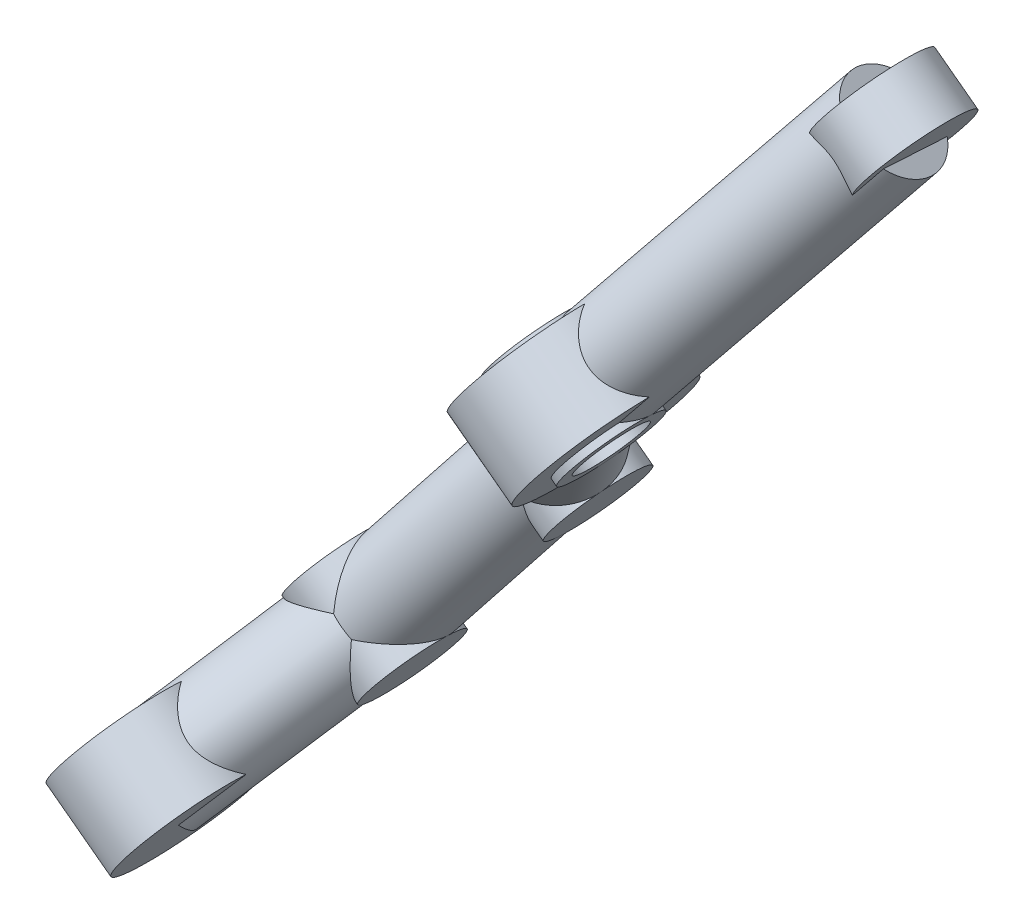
ISO-10303-21;
HEADER;
FILE_DESCRIPTION(('STEP AP214'),'2;1');
FILE_NAME('part.step','',(''),(''),'','','');
FILE_SCHEMA(('AUTOMOTIVE_DESIGN { 1 0 10303 214 1 1 1 1 }'));
ENDSEC;
DATA;
#1=APPLICATION_CONTEXT('core data for automotive mechanical design processes');
#2=APPLICATION_PROTOCOL_DEFINITION('international standard','automotive_design',2000,#1);
#3=PRODUCT_CONTEXT('',#1,'mechanical');
#4=PRODUCT('Part','Part','',(#3));
#5=PRODUCT_RELATED_PRODUCT_CATEGORY('part','',(#4));
#6=PRODUCT_DEFINITION_FORMATION('','',#4);
#7=PRODUCT_DEFINITION_CONTEXT('part definition',#1,'design');
#8=PRODUCT_DEFINITION('design','',#6,#7);
#9=PRODUCT_DEFINITION_SHAPE('','',#8);
#10=(LENGTH_UNIT() NAMED_UNIT(*) SI_UNIT(.MILLI.,.METRE.));
#11=(NAMED_UNIT(*) PLANE_ANGLE_UNIT() SI_UNIT($,.RADIAN.));
#12=(NAMED_UNIT(*) SI_UNIT($,.STERADIAN.) SOLID_ANGLE_UNIT());
#13=UNCERTAINTY_MEASURE_WITH_UNIT(LENGTH_MEASURE(1.E-05),#10,'distance_accuracy_value','');
#14=(GEOMETRIC_REPRESENTATION_CONTEXT(3) GLOBAL_UNCERTAINTY_ASSIGNED_CONTEXT((#13)) GLOBAL_UNIT_ASSIGNED_CONTEXT((#10,
#11,#12)) REPRESENTATION_CONTEXT('',''));
#15=CARTESIAN_POINT('',(0.,0.,0.));
#16=DIRECTION('',(0.,0.,1.));
#17=DIRECTION('',(1.,0.,0.));
#18=AXIS2_PLACEMENT_3D('',#15,#16,#17);
#19=CARTESIAN_POINT('',(-263.128358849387,316.504901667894,-22.));
#20=DIRECTION('',(-0.479301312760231,-0.640523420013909,0.600000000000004));
#21=DIRECTION('',(0.,-0.683643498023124,-0.729816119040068));
#22=AXIS2_PLACEMENT_3D('',#19,#20,#21);
#23=PLANE('',#22);
#24=CARTESIAN_POINT('',(-263.128358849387,316.504901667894,-22.));
#25=DIRECTION('',(-0.479301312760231,-0.640523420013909,0.600000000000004));
#26=DIRECTION('',(0.,-0.683643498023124,-0.729816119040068));
#27=AXIS2_PLACEMENT_3D('',#24,#25,#26);
#28=CIRCLE('',#27,3.5);
#29=CARTESIAN_POINT('',(-261.374450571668,313.841481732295,-23.442220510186));
#30=VERTEX_POINT('',#29);
#31=CARTESIAN_POINT('',(-260.078341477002,315.573561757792,-20.557779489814));
#32=VERTEX_POINT('',#31);
#33=EDGE_CURVE('E276',#30,#32,#28,.T.);
#34=ORIENTED_EDGE('',*,*,#33,.T.);
#35=DIRECTION('',(-0.359475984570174,-0.480392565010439,-0.799999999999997));
#36=VECTOR('',#35,1.);
#37=CARTESIAN_POINT('',(-260.726396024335,314.707521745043,-22.));
#38=LINE('',#37,#36);
#39=EDGE_CURVE('E301',#32,#30,#38,.T.);
#40=ORIENTED_EDGE('',*,*,#39,.T.);
#41=EDGE_LOOP('',(#34,#40));
#42=FACE_BOUND('',#41,.T.);
#43=ADVANCED_FACE('F100',(#42),#23,.T.);
#44=CARTESIAN_POINT('',(-255.938839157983,326.112752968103,-31.));
#45=DIRECTION('',(-0.479301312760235,-0.640523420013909,0.6));
#46=DIRECTION('',(0.,-0.683643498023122,-0.72981611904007));
#47=AXIS2_PLACEMENT_3D('',#44,#45,#46);
#48=CYLINDRICAL_SURFACE('',#47,3.5);
#49=CARTESIAN_POINT('',(-255.938839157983,326.112752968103,-31.));
#50=DIRECTION('',(-0.905065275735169,-0.0292719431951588,0.42426406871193));
#51=DIRECTION('',(0.227230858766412,-0.876564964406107,0.424264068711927));
#52=AXIS2_PLACEMENT_3D('',#49,#50,#51);
#53=ELLIPSE('',#52,4.94974746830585,3.5);
#54=CARTESIAN_POINT('',(-254.450036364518,326.718397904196,-27.7822113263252));
#55=VERTEX_POINT('',#54);
#56=CARTESIAN_POINT('',(-254.814103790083,321.773977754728,-28.9));
#57=VERTEX_POINT('',#56);
#58=EDGE_CURVE('E512',#55,#57,#53,.F.);
#59=ORIENTED_EDGE('',*,*,#58,.F.);
#60=CARTESIAN_POINT('',(-255.938839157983,326.112752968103,-31.));
#61=DIRECTION('',(-0.55081797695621,-0.736096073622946,0.393398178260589));
#62=DIRECTION('',(-0.235695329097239,-0.314975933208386,-0.919368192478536));
#63=AXIS2_PLACEMENT_3D('',#60,#61,#62);
#64=ELLIPSE('',#63,3.60255219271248,3.49999999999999);
#65=CARTESIAN_POINT('',(-255.777774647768,327.711939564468,-27.7822113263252));
#66=VERTEX_POINT('',#65);
#67=EDGE_CURVE('E484',#55,#66,#64,.T.);
#68=ORIENTED_EDGE('',*,*,#67,.T.);
#69=CARTESIAN_POINT('',(-255.938839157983,326.112752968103,-31.));
#70=DIRECTION('',(0.227230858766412,-0.876564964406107,0.424264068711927));
#71=DIRECTION('',(-0.905065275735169,-0.0292719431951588,0.42426406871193));
#72=AXIS2_PLACEMENT_3D('',#69,#70,#71);
#73=ELLIPSE('',#72,4.94974746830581,3.5);
#74=CARTESIAN_POINT('',(-260.418683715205,325.96786424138,-28.9));
#75=VERTEX_POINT('',#74);
#76=EDGE_CURVE('E505',#75,#66,#73,.F.);
#77=ORIENTED_EDGE('',*,*,#76,.F.);
#78=CARTESIAN_POINT('',(-257.197005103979,324.431378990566,-33.8));
#79=VERTEX_POINT('',#78);
#80=EDGE_CURVE('E508',#79,#75,#73,.F.);
#81=ORIENTED_EDGE('',*,*,#80,.F.);
#82=EDGE_CURVE('E509',#57,#79,#53,.F.);
#83=ORIENTED_EDGE('',*,*,#82,.F.);
#84=EDGE_LOOP('',(#59,#68,#77,#81,#83));
#85=FACE_BOUND('',#84,.T.);
#86=CARTESIAN_POINT('',(-257.843028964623,318.560764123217,-23.3559932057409));
#87=CARTESIAN_POINT('',(-257.870763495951,318.614341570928,-23.2627581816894));
#88=CARTESIAN_POINT('',(-257.903463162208,318.667500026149,-23.170817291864));
#89=CARTESIAN_POINT('',(-257.977981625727,318.773137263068,-22.9903806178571));
#90=CARTESIAN_POINT('',(-258.019794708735,318.825616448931,-22.9018827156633));
#91=CARTESIAN_POINT('',(-258.11203792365,318.93042949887,-22.7285584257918));
#92=CARTESIAN_POINT('',(-258.162517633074,318.982760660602,-22.6437568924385));
#93=CARTESIAN_POINT('',(-258.271191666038,319.087312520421,-22.4791614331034));
#94=CARTESIAN_POINT('',(-258.329387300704,319.139533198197,-22.3993683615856));
#95=CARTESIAN_POINT('',(-258.452725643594,319.244226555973,-22.2457518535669));
#96=CARTESIAN_POINT('',(-258.517857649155,319.29669873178,-22.171919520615));
#97=CARTESIAN_POINT('',(-258.654442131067,319.402479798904,-22.0310791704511));
#98=CARTESIAN_POINT('',(-258.725895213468,319.455788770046,-21.9640718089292));
#99=CARTESIAN_POINT('',(-258.948445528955,319.617634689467,-21.7752716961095));
#100=CARTESIAN_POINT('',(-259.108243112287,319.728504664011,-21.6650616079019));
#101=CARTESIAN_POINT('',(-259.389881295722,319.92347788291,-21.5162609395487));
#102=CARTESIAN_POINT('',(-259.507529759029,320.004810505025,-21.4660380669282));
#103=CARTESIAN_POINT('',(-259.746705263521,320.17282529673,-21.3898051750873));
#104=CARTESIAN_POINT('',(-259.868224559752,320.259497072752,-21.3637496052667));
#105=CARTESIAN_POINT('',(-260.111621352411,320.43752746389,-21.3385991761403));
#106=CARTESIAN_POINT('',(-260.233497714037,320.528906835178,-21.3396361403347));
#107=CARTESIAN_POINT('',(-260.473041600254,320.712902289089,-21.3688613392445));
#108=CARTESIAN_POINT('',(-260.590704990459,320.805519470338,-21.3970755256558));
#109=CARTESIAN_POINT('',(-260.838313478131,321.00311578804,-21.484184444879));
#110=CARTESIAN_POINT('',(-260.96710113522,321.107626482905,-21.5473576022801));
#111=CARTESIAN_POINT('',(-261.215801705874,321.308092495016,-21.6997528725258));
#112=CARTESIAN_POINT('',(-261.335690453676,321.404024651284,-21.7890428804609));
#113=CARTESIAN_POINT('',(-261.599588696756,321.60778988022,-22.0149625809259));
#114=CARTESIAN_POINT('',(-261.741235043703,321.711709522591,-22.1578608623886));
#115=CARTESIAN_POINT('',(-262.015022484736,321.892352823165,-22.4674356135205));
#116=CARTESIAN_POINT('',(-262.147177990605,321.969118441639,-22.6340748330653));
#117=CARTESIAN_POINT('',(-262.339292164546,322.059101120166,-22.8966596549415));
#118=CARTESIAN_POINT('',(-262.402273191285,322.084892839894,-22.9862327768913));
#119=CARTESIAN_POINT('',(-262.526152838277,322.127282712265,-23.1687503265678));
#120=CARTESIAN_POINT('',(-262.58705390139,322.143892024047,-23.2616905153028));
#121=CARTESIAN_POINT('',(-262.646954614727,322.155523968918,-23.3559932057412));
#122=B_SPLINE_CURVE_WITH_KNOTS('',3,(#86,#87,#88,#89,#90,#91,#92,#93,#94,#95,#96,#97,#98,#99,
#100,#101,#102,#103,#104,#105,#106,#107,#108,#109,#110,#111,#112,#113,#114,#115,#116,#117,#118,
#119,#120,#121),.UNSPECIFIED.,.F.,.F.,(4,2,2,2,2,2,2,2,2,2,2,2,2,2,2,2,2,4),(0.,
0.332966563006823,0.66572494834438,1.00045449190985,1.3352409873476,1.66951820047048,
2.00382749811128,2.66972985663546,3.1228015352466,3.57501751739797,4.02943424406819,
4.48428532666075,5.01385226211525,5.54480832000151,6.22088122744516,6.89590480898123,
7.23299855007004,7.56968172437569),.UNSPECIFIED.);
#123=CARTESIAN_POINT('',(-257.843028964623,318.560764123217,-23.3559932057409));
#124=VERTEX_POINT('',#123);
#125=CARTESIAN_POINT('',(-262.646954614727,322.155523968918,-23.3559932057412));
#126=VERTEX_POINT('',#125);
#127=EDGE_CURVE('E118',#124,#126,#122,.T.);
#128=ORIENTED_EDGE('',*,*,#127,.F.);
#129=DIRECTION('',(-0.479301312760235,-0.640523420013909,0.6));
#130=VECTOR('',#129,1.);
#131=CARTESIAN_POINT('',(-252.888821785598,325.181413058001,-29.557779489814));
#132=LINE('',#131,#130);
#133=EDGE_CURVE('E12',#124,#32,#132,.T.);
#134=ORIENTED_EDGE('',*,*,#133,.T.);
#135=ORIENTED_EDGE('',*,*,#33,.F.);
#136=DIRECTION('',(-0.479301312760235,-0.640523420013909,0.6));
#137=VECTOR('',#136,1.);
#138=CARTESIAN_POINT('',(-254.184930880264,323.449333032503,-32.442220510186));
#139=LINE('',#138,#137);
#140=CARTESIAN_POINT('',(-259.139138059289,316.82868409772,-26.2404342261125));
#141=VERTEX_POINT('',#140);
#142=EDGE_CURVE('E270',#30,#141,#139,.F.);
#143=ORIENTED_EDGE('',*,*,#142,.T.);
#144=CARTESIAN_POINT('',(-263.943063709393,320.423443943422,-26.2404342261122));
#145=CARTESIAN_POINT('',(-263.948800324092,320.325136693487,-26.2917693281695));
#146=CARTESIAN_POINT('',(-263.951366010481,320.224850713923,-26.3395642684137));
#147=CARTESIAN_POINT('',(-263.950003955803,320.021449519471,-26.4284221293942));
#148=CARTESIAN_POINT('',(-263.94608027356,319.918336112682,-26.469489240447));
#149=CARTESIAN_POINT('',(-263.931552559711,319.709666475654,-26.5455275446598));
#150=CARTESIAN_POINT('',(-263.920909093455,319.604099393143,-26.5804611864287));
#151=CARTESIAN_POINT('',(-263.892639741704,319.39209720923,-26.6444042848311));
#152=CARTESIAN_POINT('',(-263.875012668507,319.285661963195,-26.6734127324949));
#153=CARTESIAN_POINT('',(-263.832415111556,319.073069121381,-26.7259561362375));
#154=CARTESIAN_POINT('',(-263.807455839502,318.966911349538,-26.7494993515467));
#155=CARTESIAN_POINT('',(-263.749681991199,318.755810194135,-26.7916828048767));
#156=CARTESIAN_POINT('',(-263.716866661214,318.650866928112,-26.8103225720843));
#157=CARTESIAN_POINT('',(-263.605785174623,318.340057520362,-26.8595835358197));
#158=CARTESIAN_POINT('',(-263.514721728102,318.137333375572,-26.8837507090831));
#159=CARTESIAN_POINT('',(-263.328354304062,317.815043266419,-26.9132893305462));
#160=CARTESIAN_POINT('',(-263.243707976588,317.689607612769,-26.9221993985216));
#161=CARTESIAN_POINT('',(-263.05510782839,317.454005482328,-26.9351209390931));
#162=CARTESIAN_POINT('',(-262.951190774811,317.343810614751,-26.9391416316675));
#163=CARTESIAN_POINT('',(-262.724778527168,317.143082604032,-26.9430304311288));
#164=CARTESIAN_POINT('',(-262.602195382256,317.052647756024,-26.9428782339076));
#165=CARTESIAN_POINT('',(-262.342928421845,316.895009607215,-26.9383428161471));
#166=CARTESIAN_POINT('',(-262.206231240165,316.827828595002,-26.9339555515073));
#167=CARTESIAN_POINT('',(-261.900961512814,316.707288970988,-26.9190282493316));
#168=CARTESIAN_POINT('',(-261.730841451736,316.658013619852,-26.90759591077));
#169=CARTESIAN_POINT('',(-261.385669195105,316.586469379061,-26.8759660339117));
#170=CARTESIAN_POINT('',(-261.21060523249,316.564271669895,-26.8557455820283));
#171=CARTESIAN_POINT('',(-260.812903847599,316.53931681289,-26.7973236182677));
#172=CARTESIAN_POINT('',(-260.590341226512,316.543531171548,-26.7557181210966));
#173=CARTESIAN_POINT('',(-260.153376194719,316.580953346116,-26.6504126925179));
#174=CARTESIAN_POINT('',(-259.938961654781,316.614116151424,-26.5867471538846));
#175=CARTESIAN_POINT('',(-259.62883742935,316.681838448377,-26.4718899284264));
#176=CARTESIAN_POINT('',(-259.527438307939,316.707387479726,-26.4304094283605));
#177=CARTESIAN_POINT('',(-259.329471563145,316.764005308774,-26.3406357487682));
#178=CARTESIAN_POINT('',(-259.232898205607,316.795067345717,-26.292350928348));
#179=CARTESIAN_POINT('',(-259.139138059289,316.82868409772,-26.2404342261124));
#180=B_SPLINE_CURVE_WITH_KNOTS('',3,(#144,#145,#146,#147,#148,#149,#150,#151,#152,#153,#154,
#155,#156,#157,#158,#159,#160,#161,#162,#163,#164,#165,#166,#167,#168,#169,#170,#171,#172,#173,
#174,#175,#176,#177,#178,#179),.UNSPECIFIED.,.F.,.F.,(4,2,2,2,2,2,2,2,2,2,2,2,2,2,2,2,2,4),(0.,
0.332966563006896,0.665724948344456,1.00045449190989,1.33524098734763,1.66951820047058,
2.00382749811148,2.66972985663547,3.12280153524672,3.57501751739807,4.0294342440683,
4.48428532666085,5.01385226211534,5.54480832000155,6.22088122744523,6.89590480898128,
7.23299855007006,7.56968172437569),.UNSPECIFIED.);
#181=CARTESIAN_POINT('',(-263.943063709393,320.423443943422,-26.2404342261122));
#182=VERTEX_POINT('',#181);
#183=EDGE_CURVE('E273',#182,#141,#180,.T.);
#184=ORIENTED_EDGE('',*,*,#183,.F.);
#185=DIRECTION('',(-0.479301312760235,-0.640523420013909,0.6));
#186=VECTOR('',#185,1.);
#187=CARTESIAN_POINT('',(-258.988856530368,327.044092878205,-32.4422205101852));
#188=LINE('',#187,#186);
#189=CARTESIAN_POINT('',(-266.178376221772,317.436241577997,-23.4422205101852));
#190=VERTEX_POINT('',#189);
#191=EDGE_CURVE('E280',#190,#182,#188,.F.);
#192=ORIENTED_EDGE('',*,*,#191,.F.);
#193=CARTESIAN_POINT('',(-264.882267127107,319.168321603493,-20.5577794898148));
#194=VERTEX_POINT('',#193);
#195=EDGE_CURVE('E541',#194,#190,#28,.T.);
#196=ORIENTED_EDGE('',*,*,#195,.F.);
#197=DIRECTION('',(-0.479301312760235,-0.640523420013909,0.6));
#198=VECTOR('',#197,1.);
#199=CARTESIAN_POINT('',(-257.692747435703,328.776172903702,-29.5577794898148));
#200=LINE('',#199,#198);
#201=EDGE_CURVE('E109',#126,#194,#200,.T.);
#202=ORIENTED_EDGE('',*,*,#201,.F.);
#203=EDGE_LOOP('',(#128,#134,#135,#143,#184,#192,#196,#202));
#204=FACE_BOUND('',#203,.T.);
#205=ADVANCED_FACE('F272',(#85,#204),#48,.T.);
#206=CARTESIAN_POINT('',(-219.392114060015,374.952663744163,-33.));
#207=DIRECTION('',(-0.581238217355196,-0.776748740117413,0.242535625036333));
#208=DIRECTION('',(0.800654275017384,-0.599126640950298,0.));
#209=AXIS2_PLACEMENT_3D('',#206,#207,#208);
#210=CYLINDRICAL_SURFACE('',#209,3.49999999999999);
#211=CARTESIAN_POINT('',(-230.177448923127,355.532187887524,-25.6390242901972));
#212=CARTESIAN_POINT('',(-230.223188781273,355.559481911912,-25.5467728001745));
#213=CARTESIAN_POINT('',(-230.273076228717,355.587355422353,-25.4567871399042));
#214=CARTESIAN_POINT('',(-230.380347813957,355.644536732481,-25.2819265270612));
#215=CARTESIAN_POINT('',(-230.437729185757,355.673844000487,-25.1970497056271));
#216=CARTESIAN_POINT('',(-230.559465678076,355.734307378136,-25.0325918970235));
#217=CARTESIAN_POINT('',(-230.623847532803,355.76547035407,-24.9530332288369));
#218=CARTESIAN_POINT('',(-230.758606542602,355.829907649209,-24.8001161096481));
#219=CARTESIAN_POINT('',(-230.828984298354,355.863182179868,-24.7267582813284));
#220=CARTESIAN_POINT('',(-231.047916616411,355.966773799,-24.5168435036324));
#221=CARTESIAN_POINT('',(-231.204431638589,356.040935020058,-24.390229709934));
#222=CARTESIAN_POINT('',(-231.531781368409,356.203197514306,-24.1689896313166));
#223=CARTESIAN_POINT('',(-231.702583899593,356.291267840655,-24.0742937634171));
#224=CARTESIAN_POINT('',(-232.013562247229,356.464074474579,-23.9387636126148));
#225=CARTESIAN_POINT('',(-232.152444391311,356.54547020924,-23.8907316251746));
#226=CARTESIAN_POINT('',(-232.429704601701,356.719457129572,-23.8206470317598));
#227=CARTESIAN_POINT('',(-232.568083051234,356.812036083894,-23.7985663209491));
#228=CARTESIAN_POINT('',(-232.839907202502,357.007209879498,-23.7819229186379));
#229=CARTESIAN_POINT('',(-232.973339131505,357.109830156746,-23.7874319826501));
#230=CARTESIAN_POINT('',(-233.230983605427,357.321392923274,-23.8257058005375));
#231=CARTESIAN_POINT('',(-233.355191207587,357.430338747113,-23.8584850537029));
#232=CARTESIAN_POINT('',(-233.588875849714,357.646759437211,-23.9477375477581));
#233=CARTESIAN_POINT('',(-233.698674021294,357.754186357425,-24.0035015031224));
#234=CARTESIAN_POINT('',(-233.907477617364,357.966624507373,-24.1359177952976));
#235=CARTESIAN_POINT('',(-234.006475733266,358.071634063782,-24.2125841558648));
#236=CARTESIAN_POINT('',(-234.208938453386,358.291474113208,-24.3976034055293));
#237=CARTESIAN_POINT('',(-234.310693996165,358.405284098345,-24.5090326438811));
#238=CARTESIAN_POINT('',(-234.501912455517,358.619762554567,-24.7529505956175));
#239=CARTESIAN_POINT('',(-234.591380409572,358.720436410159,-24.885430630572));
#240=CARTESIAN_POINT('',(-234.731205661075,358.873528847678,-25.1215089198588));
#241=CARTESIAN_POINT('',(-234.784691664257,358.930876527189,-25.2201094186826));
#242=CARTESIAN_POINT('',(-234.886698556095,359.036224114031,-25.4244236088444));
#243=CARTESIAN_POINT('',(-234.935225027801,359.084234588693,-25.5301290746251));
#244=CARTESIAN_POINT('',(-234.981374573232,359.126947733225,-25.6390242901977));
#245=B_SPLINE_CURVE_WITH_KNOTS('',3,(#211,#212,#213,#214,#215,#216,#217,#218,#219,#220,#221,
#222,#223,#224,#225,#226,#227,#228,#229,#230,#231,#232,#233,#234,#235,#236,#237,#238,#239,#240,
#241,#242,#243,#244),.UNSPECIFIED.,.F.,.F.,(4,2,2,2,2,2,2,2,2,2,2,2,2,2,2,2,4),(0.,
0.319418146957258,0.638718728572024,0.959284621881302,1.27988266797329,1.92024942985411,
2.55921098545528,3.06104886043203,3.56234275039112,4.06494108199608,4.56780681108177,
5.0561957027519,5.54491307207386,6.10980771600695,6.6744700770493,7.05181727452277,
7.42873489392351),.UNSPECIFIED.);
#246=CARTESIAN_POINT('',(-230.177448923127,355.532187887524,-25.6390242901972));
#247=VERTEX_POINT('',#246);
#248=CARTESIAN_POINT('',(-234.981374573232,359.126947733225,-25.6390242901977));
#249=VERTEX_POINT('',#248);
#250=EDGE_CURVE('E360',#247,#249,#245,.T.);
#251=ORIENTED_EDGE('',*,*,#250,.F.);
#252=DIRECTION('',(-0.581238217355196,-0.776748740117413,0.242535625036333));
#253=VECTOR('',#252,1.);
#254=CARTESIAN_POINT('',(-216.728190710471,373.505359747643,-31.2510507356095));
#255=LINE('',#254,#253);
#256=CARTESIAN_POINT('',(-231.760022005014,353.417286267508,-24.9786576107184));
#257=VERTEX_POINT('',#256);
#258=EDGE_CURVE('E344',#247,#257,#255,.T.);
#259=ORIENTED_EDGE('',*,*,#258,.T.);
#260=CARTESIAN_POINT('',(-236.167660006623,352.534344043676,-26.));
#261=DIRECTION('',(0.155150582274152,-0.972890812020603,0.171498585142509));
#262=DIRECTION('',(-0.977145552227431,-0.125597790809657,0.171498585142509));
#263=AXIS2_PLACEMENT_3D('',#260,#261,#262);
#264=ELLIPSE('',#263,4.94974746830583,3.5);
#265=CARTESIAN_POINT('',(-231.331036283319,353.156021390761,-26.8488746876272));
#266=VERTEX_POINT('',#265);
#267=EDGE_CURVE('E533',#266,#257,#264,.T.);
#268=ORIENTED_EDGE('',*,*,#267,.F.);
#269=CARTESIAN_POINT('',(-232.283943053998,352.717134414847,-28.4765561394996));
#270=VERTEX_POINT('',#269);
#271=EDGE_CURVE('E539',#270,#266,#264,.T.);
#272=ORIENTED_EDGE('',*,*,#271,.F.);
#273=DIRECTION('',(-0.581238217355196,-0.776748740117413,0.242535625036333));
#274=VECTOR('',#273,1.);
#275=CARTESIAN_POINT('',(-217.252111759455,372.805207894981,-34.7489492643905));
#276=LINE('',#275,#274);
#277=CARTESIAN_POINT('',(-230.701369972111,354.832036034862,-29.1369228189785));
#278=VERTEX_POINT('',#277);
#279=EDGE_CURVE('E350',#270,#278,#276,.F.);
#280=ORIENTED_EDGE('',*,*,#279,.T.);
#281=CARTESIAN_POINT('',(-235.505295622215,358.426795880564,-29.1369228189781));
#282=CARTESIAN_POINT('',(-235.491825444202,358.356377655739,-29.2157090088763));
#283=CARTESIAN_POINT('',(-235.475848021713,358.283187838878,-29.2915448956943));
#284=CARTESIAN_POINT('',(-235.438725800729,358.132261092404,-29.4371339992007));
#285=CARTESIAN_POINT('',(-235.417582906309,358.05452584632,-29.5068894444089));
#286=CARTESIAN_POINT('',(-235.369872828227,357.895135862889,-29.6404579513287));
#287=CARTESIAN_POINT('',(-235.343284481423,357.81346681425,-29.7042463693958));
#288=CARTESIAN_POINT('',(-235.284508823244,357.64748772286,-29.8254576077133));
#289=CARTESIAN_POINT('',(-235.25232095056,357.563177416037,-29.8828797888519));
#290=CARTESIAN_POINT('',(-235.146961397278,357.307810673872,-30.0454035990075));
#291=CARTESIAN_POINT('',(-235.064933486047,357.134107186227,-30.14093585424));
#292=CARTESIAN_POINT('',(-234.874627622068,356.788703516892,-30.3049910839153));
#293=CARTESIAN_POINT('',(-234.766407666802,356.616999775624,-30.3735728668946));
#294=CARTESIAN_POINT('',(-234.547725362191,356.320851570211,-30.4705902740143));
#295=CARTESIAN_POINT('',(-234.442728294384,356.194172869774,-30.5044828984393));
#296=CARTESIAN_POINT('',(-234.215464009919,355.953372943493,-30.5537054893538));
#297=CARTESIAN_POINT('',(-234.093215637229,355.839238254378,-30.569055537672));
#298=CARTESIAN_POINT('',(-233.83351635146,355.627861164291,-30.5806395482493));
#299=CARTESIAN_POINT('',(-233.696026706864,355.530663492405,-30.5768236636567));
#300=CARTESIAN_POINT('',(-233.4106443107,355.356168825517,-30.5501241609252));
#301=CARTESIAN_POINT('',(-233.262746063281,355.278882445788,-30.5272303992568));
#302=CARTESIAN_POINT('',(-232.966374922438,355.146234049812,-30.4641353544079));
#303=CARTESIAN_POINT('',(-232.818041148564,355.090304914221,-30.4244513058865));
#304=CARTESIAN_POINT('',(-232.521165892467,354.995563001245,-30.3287850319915));
#305=CARTESIAN_POINT('',(-232.372624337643,354.956761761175,-30.2727918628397));
#306=CARTESIAN_POINT('',(-232.056291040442,354.889094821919,-30.1352878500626));
#307=CARTESIAN_POINT('',(-231.889107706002,354.862720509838,-30.0511599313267));
#308=CARTESIAN_POINT('',(-231.564656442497,354.826290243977,-29.8628365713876));
#309=CARTESIAN_POINT('',(-231.407384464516,354.816227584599,-29.7586493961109));
#310=CARTESIAN_POINT('',(-231.157240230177,354.810562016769,-29.5686043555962));
#311=CARTESIAN_POINT('',(-231.060311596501,354.81126972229,-29.4881313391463));
#312=CARTESIAN_POINT('',(-230.874499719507,354.817916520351,-29.3187867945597));
#313=CARTESIAN_POINT('',(-230.785607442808,354.823849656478,-29.229924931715));
#314=CARTESIAN_POINT('',(-230.701369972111,354.832036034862,-29.1369228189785));
#315=B_SPLINE_CURVE_WITH_KNOTS('',3,(#281,#282,#283,#284,#285,#286,#287,#288,#289,#290,#291,
#292,#293,#294,#295,#296,#297,#298,#299,#300,#301,#302,#303,#304,#305,#306,#307,#308,#309,#310,
#311,#312,#313,#314),.UNSPECIFIED.,.F.,.F.,(4,2,2,2,2,2,2,2,2,2,2,2,2,2,2,2,4),(0.,
0.31941814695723,0.638718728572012,0.959284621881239,1.27988266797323,1.92024942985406,
2.55921098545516,3.06104886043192,3.56234275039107,4.06494108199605,4.56780681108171,
5.05619570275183,5.5449130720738,6.1098077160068,6.67447007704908,7.05181727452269,
7.42873489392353),.UNSPECIFIED.);
#316=CARTESIAN_POINT('',(-235.505295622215,358.426795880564,-29.1369228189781));
#317=VERTEX_POINT('',#316);
#318=EDGE_CURVE('E352',#317,#278,#315,.T.);
#319=ORIENTED_EDGE('',*,*,#318,.F.);
#320=DIRECTION('',(-0.581238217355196,-0.776748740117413,0.242535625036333));
#321=VECTOR('',#320,1.);
#322=CARTESIAN_POINT('',(-222.056037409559,376.399967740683,-34.7489492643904));
#323=LINE('',#322,#321);
#324=CARTESIAN_POINT('',(-237.087868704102,356.311894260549,-28.4765561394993));
#325=VERTEX_POINT('',#324);
#326=EDGE_CURVE('E330',#325,#317,#323,.F.);
#327=ORIENTED_EDGE('',*,*,#326,.F.);
#328=CARTESIAN_POINT('',(-236.167660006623,352.534344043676,-26.));
#329=DIRECTION('',(-0.977145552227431,-0.125597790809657,0.171498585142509));
#330=DIRECTION('',(0.155150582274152,-0.972890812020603,0.171498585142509));
#331=AXIS2_PLACEMENT_3D('',#328,#329,#330);
#332=ELLIPSE('',#331,4.94974746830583,3.5);
#333=CARTESIAN_POINT('',(-236.935616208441,357.349907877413,-26.8488746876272));
#334=VERTEX_POINT('',#333);
#335=EDGE_CURVE('E542',#334,#325,#332,.T.);
#336=ORIENTED_EDGE('',*,*,#335,.F.);
#337=CARTESIAN_POINT('',(-236.563947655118,357.01204611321,-24.9786576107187));
#338=VERTEX_POINT('',#337);
#339=EDGE_CURVE('E540',#338,#334,#332,.T.);
#340=ORIENTED_EDGE('',*,*,#339,.F.);
#341=DIRECTION('',(-0.581238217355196,-0.776748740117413,0.242535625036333));
#342=VECTOR('',#341,1.);
#343=CARTESIAN_POINT('',(-221.532116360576,377.100119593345,-31.2510507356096));
#344=LINE('',#343,#342);
#345=EDGE_CURVE('E339',#249,#338,#344,.T.);
#346=ORIENTED_EDGE('',*,*,#345,.F.);
#347=EDGE_LOOP('',(#251,#259,#268,#272,#280,#319,#327,#336,#340,#346));
#348=FACE_BOUND('',#347,.T.);
#349=CARTESIAN_POINT('',(-219.826274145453,371.034273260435,-35.1113315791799));
#350=CARTESIAN_POINT('',(-219.859436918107,371.104169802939,-35.1694417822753));
#351=CARTESIAN_POINT('',(-219.893536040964,371.17558254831,-35.2252178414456));
#352=CARTESIAN_POINT('',(-219.964358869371,371.320948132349,-35.3319127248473));
#353=CARTESIAN_POINT('',(-220.001087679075,371.394905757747,-35.3828216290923));
#354=CARTESIAN_POINT('',(-220.078573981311,371.546105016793,-35.4803394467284));
#355=CARTESIAN_POINT('',(-220.119398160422,371.623382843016,-35.5268399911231));
#356=CARTESIAN_POINT('',(-220.205454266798,371.778812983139,-35.6137518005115));
#357=CARTESIAN_POINT('',(-220.25068222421,371.85696445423,-35.6541684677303));
#358=CARTESIAN_POINT('',(-220.357224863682,372.02969358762,-35.7360463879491));
#359=CARTESIAN_POINT('',(-220.419912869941,372.124218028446,-35.7758903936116));
#360=CARTESIAN_POINT('',(-220.556425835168,372.309023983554,-35.8429640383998));
#361=CARTESIAN_POINT('',(-220.630181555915,372.39932759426,-35.8702680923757));
#362=CARTESIAN_POINT('',(-220.777297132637,372.556317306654,-35.9062129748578));
#363=CARTESIAN_POINT('',(-220.848547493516,372.624395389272,-35.9172544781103));
#364=CARTESIAN_POINT('',(-220.999660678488,372.751254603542,-35.9275716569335));
#365=CARTESIAN_POINT('',(-221.079517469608,372.810042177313,-35.9268555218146));
#366=CARTESIAN_POINT('',(-221.245021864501,372.916462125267,-35.9137901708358));
#367=CARTESIAN_POINT('',(-221.330650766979,372.964128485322,-35.9014769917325));
#368=CARTESIAN_POINT('',(-221.504944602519,373.049252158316,-35.8666138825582));
#369=CARTESIAN_POINT('',(-221.5936159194,373.086686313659,-35.8440410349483));
#370=CARTESIAN_POINT('',(-221.760205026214,373.149001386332,-35.7937277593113));
#371=CARTESIAN_POINT('',(-221.838074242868,373.174868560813,-35.7669928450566));
#372=CARTESIAN_POINT('',(-221.993175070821,373.221662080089,-35.7079044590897));
#373=CARTESIAN_POINT('',(-222.07040634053,373.242585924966,-35.6755481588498));
#374=CARTESIAN_POINT('',(-222.223733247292,373.280772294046,-35.6058196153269));
#375=CARTESIAN_POINT('',(-222.299825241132,373.298024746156,-35.5684340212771));
#376=CARTESIAN_POINT('',(-222.450182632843,373.329794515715,-35.4892068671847));
#377=CARTESIAN_POINT('',(-222.524448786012,373.344312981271,-35.4473671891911));
#378=CARTESIAN_POINT('',(-222.672167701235,373.37165587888,-35.3587517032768));
#379=CARTESIAN_POINT('',(-222.745581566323,373.384444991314,-35.3119004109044));
#380=CARTESIAN_POINT('',(-222.889417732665,373.408541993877,-35.2144294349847));
#381=CARTESIAN_POINT('',(-222.959856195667,373.41985885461,-35.1638358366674));
#382=CARTESIAN_POINT('',(-223.028891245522,373.430779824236,-35.1113315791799));
#383=B_SPLINE_CURVE_WITH_KNOTS('',3,(#349,#350,#351,#352,#353,#354,#355,#356,#357,#358,#359,
#360,#361,#362,#363,#364,#365,#366,#367,#368,#369,#370,#371,#372,#373,#374,#375,#376,#377,#378,
#379,#380,#381,#382),.UNSPECIFIED.,.F.,.F.,(4,2,2,2,2,2,2,2,2,2,2,2,2,2,2,2,4),(0.,
0.290250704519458,0.581080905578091,0.877819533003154,1.17429309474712,1.53402688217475,
1.8915974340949,2.18772895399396,2.48365422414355,2.77866295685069,3.07433392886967,
3.33285850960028,3.59151355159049,3.85086929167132,4.11011587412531,4.37404327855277,
4.63627861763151),.UNSPECIFIED.);
#384=CARTESIAN_POINT('',(-219.826274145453,371.034273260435,-35.1113315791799));
#385=VERTEX_POINT('',#384);
#386=CARTESIAN_POINT('',(-223.028891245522,373.430779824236,-35.1113315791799));
#387=VERTEX_POINT('',#386);
#388=EDGE_CURVE('E289',#385,#387,#383,.T.);
#389=ORIENTED_EDGE('',*,*,#388,.F.);
#390=DIRECTION('',(-0.581238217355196,-0.776748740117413,0.242535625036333));
#391=VECTOR('',#390,1.);
#392=CARTESIAN_POINT('',(-218.208175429,373.196650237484,-35.7865221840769));
#393=LINE('',#392,#391);
#394=CARTESIAN_POINT('',(-218.208175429,373.196650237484,-35.7865221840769));
#395=VERTEX_POINT('',#394);
#396=EDGE_CURVE('E316',#385,#395,#393,.F.);
#397=ORIENTED_EDGE('',*,*,#396,.T.);
#398=CARTESIAN_POINT('',(-219.392114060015,374.952663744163,-33.));
#399=DIRECTION('',(-0.581238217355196,-0.776748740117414,0.242535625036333));
#400=DIRECTION('',(0.800654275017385,-0.599126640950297,0.));
#401=AXIS2_PLACEMENT_3D('',#398,#399,#400);
#402=CIRCLE('',#401,3.49999999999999);
#403=CARTESIAN_POINT('',(-217.37343559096,374.31217068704,-30.2134778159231));
#404=VERTEX_POINT('',#403);
#405=EDGE_CURVE('E482',#395,#404,#402,.T.);
#406=ORIENTED_EDGE('',*,*,#405,.T.);
#407=DIRECTION('',(-0.581238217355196,-0.776748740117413,0.242535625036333));
#408=VECTOR('',#407,1.);
#409=CARTESIAN_POINT('',(-217.37343559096,374.31217068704,-30.2134778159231));
#410=LINE('',#409,#408);
#411=CARTESIAN_POINT('',(-218.991534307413,372.149793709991,-29.5382872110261));
#412=VERTEX_POINT('',#411);
#413=EDGE_CURVE('E313',#404,#412,#410,.T.);
#414=ORIENTED_EDGE('',*,*,#413,.T.);
#415=CARTESIAN_POINT('',(-222.194151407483,374.546300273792,-29.5382872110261));
#416=CARTESIAN_POINT('',(-222.10389898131,374.552696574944,-29.5039990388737));
#417=CARTESIAN_POINT('',(-222.012631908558,374.557681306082,-29.4720776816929));
#418=CARTESIAN_POINT('',(-221.82832242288,374.563975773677,-29.4127378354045));
#419=CARTESIAN_POINT('',(-221.735276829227,374.565278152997,-29.3853284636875));
#420=CARTESIAN_POINT('',(-221.546126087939,374.563303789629,-29.3344053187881));
#421=CARTESIAN_POINT('',(-221.449997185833,374.559933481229,-29.3109820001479));
#422=CARTESIAN_POINT('',(-221.257237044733,374.547099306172,-29.268595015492));
#423=CARTESIAN_POINT('',(-221.160606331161,374.537640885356,-29.2496273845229));
#424=CARTESIAN_POINT('',(-220.947001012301,374.507986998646,-29.2124239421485));
#425=CARTESIAN_POINT('',(-220.830085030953,374.485931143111,-29.1952078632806));
#426=CARTESIAN_POINT('',(-220.600028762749,374.426133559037,-29.1671674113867));
#427=CARTESIAN_POINT('',(-220.486869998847,374.388486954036,-29.1563052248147));
#428=CARTESIAN_POINT('',(-220.287268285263,374.30163808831,-29.142261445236));
#429=CARTESIAN_POINT('',(-220.199575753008,374.25553281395,-29.1380808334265));
#430=CARTESIAN_POINT('',(-220.033109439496,374.14919104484,-29.1341701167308));
#431=CARTESIAN_POINT('',(-219.954329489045,374.088964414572,-29.1344369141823));
#432=CARTESIAN_POINT('',(-219.808243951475,373.956593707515,-29.1393992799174));
#433=CARTESIAN_POINT('',(-219.740903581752,373.884487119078,-29.1440811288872));
#434=CARTESIAN_POINT('',(-219.617342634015,373.731565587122,-29.1577747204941));
#435=CARTESIAN_POINT('',(-219.56114735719,373.650731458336,-29.1667961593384));
#436=CARTESIAN_POINT('',(-219.465036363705,373.494231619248,-29.1877007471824));
#437=CARTESIAN_POINT('',(-219.423962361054,373.419192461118,-29.1990819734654));
#438=CARTESIAN_POINT('',(-219.348066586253,373.26655176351,-29.225120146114));
#439=CARTESIAN_POINT('',(-219.313247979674,373.188948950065,-29.2397787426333));
#440=CARTESIAN_POINT('',(-219.248699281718,373.032122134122,-29.2724624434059));
#441=CARTESIAN_POINT('',(-219.218983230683,372.952894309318,-29.2904965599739));
#442=CARTESIAN_POINT('',(-219.163869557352,372.79384378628,-29.3299809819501));
#443=CARTESIAN_POINT('',(-219.138470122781,372.714021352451,-29.3514298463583));
#444=CARTESIAN_POINT('',(-219.09085638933,372.552900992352,-29.3982740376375));
#445=CARTESIAN_POINT('',(-219.068707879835,372.471602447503,-29.4237336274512));
#446=CARTESIAN_POINT('',(-219.027781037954,372.309980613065,-29.4782632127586));
#447=CARTESIAN_POINT('',(-219.008982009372,372.229654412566,-29.5073090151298));
#448=CARTESIAN_POINT('',(-218.991534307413,372.149793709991,-29.5382872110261));
#449=B_SPLINE_CURVE_WITH_KNOTS('',3,(#415,#416,#417,#418,#419,#420,#421,#422,#423,#424,#425,
#426,#427,#428,#429,#430,#431,#432,#433,#434,#435,#436,#437,#438,#439,#440,#441,#442,#443,#444,
#445,#446,#447,#448),.UNSPECIFIED.,.F.,.F.,(4,2,2,2,2,2,2,2,2,2,2,2,2,2,2,2,4),(0.,
0.290250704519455,0.581080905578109,0.87781953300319,1.17429309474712,1.53402688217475,
1.89159743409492,2.18772895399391,2.4836542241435,2.77866295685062,3.07433392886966,
3.33285850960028,3.59151355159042,3.85086929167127,4.11011587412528,4.37404327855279,
4.63627861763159),.UNSPECIFIED.);
#450=CARTESIAN_POINT('',(-222.194151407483,374.546300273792,-29.538287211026));
#451=VERTEX_POINT('',#450);
#452=EDGE_CURVE('E456',#451,#412,#449,.T.);
#453=ORIENTED_EDGE('',*,*,#452,.F.);
#454=DIRECTION('',(-0.581238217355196,-0.776748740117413,0.242535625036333));
#455=VECTOR('',#454,1.);
#456=CARTESIAN_POINT('',(-220.57605269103,376.708677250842,-30.213477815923));
#457=LINE('',#456,#455);
#458=CARTESIAN_POINT('',(-220.57605269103,376.708677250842,-30.213477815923));
#459=VERTEX_POINT('',#458);
#460=EDGE_CURVE('E309',#459,#451,#457,.T.);
#461=ORIENTED_EDGE('',*,*,#460,.F.);
#462=CARTESIAN_POINT('',(-221.41079252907,375.593156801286,-35.7865221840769));
#463=VERTEX_POINT('',#462);
#464=EDGE_CURVE('E476',#459,#463,#402,.T.);
#465=ORIENTED_EDGE('',*,*,#464,.T.);
#466=DIRECTION('',(-0.581238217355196,-0.776748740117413,0.242535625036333));
#467=VECTOR('',#466,1.);
#468=CARTESIAN_POINT('',(-221.41079252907,375.593156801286,-35.786522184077));
#469=LINE('',#468,#467);
#470=EDGE_CURVE('E311',#387,#463,#469,.F.);
#471=ORIENTED_EDGE('',*,*,#470,.F.);
#472=EDGE_LOOP('',(#389,#397,#406,#414,#453,#461,#465,#471));
#473=FACE_BOUND('',#472,.T.);
#474=ADVANCED_FACE('F366',(#348,#473),#210,.T.);
#475=CARTESIAN_POINT('',(-219.392114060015,374.952663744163,-33.));
#476=DIRECTION('',(-0.581238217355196,-0.776748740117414,0.242535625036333));
#477=DIRECTION('',(0.800654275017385,-0.599126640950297,0.));
#478=AXIS2_PLACEMENT_3D('',#475,#476,#477);
#479=PLANE('',#478);
#480=DIRECTION('',(-0.145309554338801,-0.194187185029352,-0.970142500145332));
#481=VECTOR('',#480,1.);
#482=CARTESIAN_POINT('',(-217.79080550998,373.754410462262,-33.));
#483=LINE('',#482,#481);
#484=EDGE_CURVE('E467',#404,#395,#483,.T.);
#485=ORIENTED_EDGE('',*,*,#484,.F.);
#486=ORIENTED_EDGE('',*,*,#405,.F.);
#487=EDGE_LOOP('',(#485,#486));
#488=FACE_BOUND('',#487,.T.);
#489=ADVANCED_FACE('F405',(#488),#479,.F.);
#490=CARTESIAN_POINT('',(-236.167660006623,352.534344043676,-26.));
#491=DIRECTION('',(-0.528641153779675,-0.706459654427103,-0.470588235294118));
#492=DIRECTION('',(0.800654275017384,-0.599126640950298,0.));
#493=AXIS2_PLACEMENT_3D('',#490,#491,#492);
#494=CYLINDRICAL_SURFACE('',#493,3.49999999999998);
#495=CARTESIAN_POINT('',(-245.154559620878,340.524529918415,-34.));
#496=DIRECTION('',(-0.93995381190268,-0.0758959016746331,-0.332756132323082));
#497=DIRECTION('',(0.1923423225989,-0.923188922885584,-0.332756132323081));
#498=AXIS2_PLACEMENT_3D('',#495,#496,#497);
#499=ELLIPSE('',#498,4.94974746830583,3.49999999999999);
#500=CARTESIAN_POINT('',(-246.395189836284,340.74606730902,-30.5460551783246));
#501=VERTEX_POINT('',#500);
#502=CARTESIAN_POINT('',(-246.10660554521,345.094081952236,-32.3529411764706));
#503=VERTEX_POINT('',#502);
#504=EDGE_CURVE('E555',#501,#503,#499,.T.);
#505=ORIENTED_EDGE('',*,*,#504,.F.);
#506=CARTESIAN_POINT('',(-245.154559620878,340.524529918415,-34.));
#507=DIRECTION('',(-0.591242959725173,-0.790118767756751,-0.16169135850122));
#508=DIRECTION('',(0.0968736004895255,0.129458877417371,-0.986841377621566));
#509=AXIS2_PLACEMENT_3D('',#506,#507,#508);
#510=ELLIPSE('',#509,3.696535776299,3.49999999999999);
#511=CARTESIAN_POINT('',(-244.592044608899,339.39678038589,-30.5460551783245));
#512=VERTEX_POINT('',#511);
#513=EDGE_CURVE('E481',#512,#501,#510,.T.);
#514=ORIENTED_EDGE('',*,*,#513,.F.);
#515=CARTESIAN_POINT('',(-245.154559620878,340.524529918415,-34.));
#516=DIRECTION('',(0.1923423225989,-0.923188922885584,-0.332756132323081));
#517=DIRECTION('',(-0.93995381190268,-0.0758959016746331,-0.332756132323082));
#518=AXIS2_PLACEMENT_3D('',#515,#516,#517);
#519=ELLIPSE('',#518,4.94974746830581,3.49999999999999);
#520=CARTESIAN_POINT('',(-240.502025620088,340.900195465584,-32.3529411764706));
#521=VERTEX_POINT('',#520);
#522=EDGE_CURVE('E557',#521,#512,#519,.T.);
#523=ORIENTED_EDGE('',*,*,#522,.F.);
#524=CARTESIAN_POINT('',(-244.167762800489,341.843254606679,-37.0882352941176));
#525=VERTEX_POINT('',#524);
#526=EDGE_CURVE('E556',#525,#521,#519,.T.);
#527=ORIENTED_EDGE('',*,*,#526,.F.);
#528=EDGE_CURVE('E552',#503,#525,#499,.T.);
#529=ORIENTED_EDGE('',*,*,#528,.F.);
#530=EDGE_LOOP('',(#505,#514,#523,#527,#529));
#531=FACE_BOUND('',#530,.T.);
#532=CARTESIAN_POINT('',(-236.282706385,347.373311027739,-30.2837486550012));
#533=CARTESIAN_POINT('',(-236.285592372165,347.457873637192,-30.3484655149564));
#534=CARTESIAN_POINT('',(-236.291427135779,347.544617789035,-30.410146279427));
#535=CARTESIAN_POINT('',(-236.309157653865,347.721459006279,-30.5274746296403));
#536=CARTESIAN_POINT('',(-236.321051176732,347.811554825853,-30.5831244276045));
#537=CARTESIAN_POINT('',(-236.351123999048,347.994514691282,-30.6886861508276));
#538=CARTESIAN_POINT('',(-236.369328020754,348.087388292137,-30.738574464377));
#539=CARTESIAN_POINT('',(-236.41223782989,348.274570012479,-30.832476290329));
#540=CARTESIAN_POINT('',(-236.436944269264,348.368878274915,-30.8764892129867));
#541=CARTESIAN_POINT('',(-236.521215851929,348.652426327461,-30.9998812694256));
#542=CARTESIAN_POINT('',(-236.590970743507,348.842531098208,-31.0707496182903));
#543=CARTESIAN_POINT('',(-236.760345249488,349.215906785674,-31.1904868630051));
#544=CARTESIAN_POINT('',(-236.859898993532,349.399191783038,-31.2394036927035));
#545=CARTESIAN_POINT('',(-237.06638159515,349.711643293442,-31.3077928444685));
#546=CARTESIAN_POINT('',(-237.167142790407,349.843982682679,-31.3313312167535));
#547=CARTESIAN_POINT('',(-237.388267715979,350.092987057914,-31.3653475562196));
#548=CARTESIAN_POINT('',(-237.508610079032,350.209668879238,-31.3758396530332));
#549=CARTESIAN_POINT('',(-237.766870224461,350.422969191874,-31.3837678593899));
#550=CARTESIAN_POINT('',(-237.904832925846,350.519534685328,-31.3811699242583));
#551=CARTESIAN_POINT('',(-238.193535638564,350.689592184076,-31.362851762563));
#552=CARTESIAN_POINT('',(-238.34428240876,350.763071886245,-31.3471245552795));
#553=CARTESIAN_POINT('',(-238.648545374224,350.885173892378,-31.3032203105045));
#554=CARTESIAN_POINT('',(-238.801856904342,350.934450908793,-31.2754147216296));
#555=CARTESIAN_POINT('',(-239.110808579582,351.013054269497,-31.2073459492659));
#556=CARTESIAN_POINT('',(-239.266450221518,351.042367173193,-31.1670743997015));
#557=CARTESIAN_POINT('',(-239.600343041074,351.086568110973,-31.066502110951));
#558=CARTESIAN_POINT('',(-239.778336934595,351.098495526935,-31.0040578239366));
#559=CARTESIAN_POINT('',(-240.12719786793,351.102305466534,-30.8614289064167));
#560=CARTESIAN_POINT('',(-240.298067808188,351.09419623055,-30.7812515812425));
#561=CARTESIAN_POINT('',(-240.573227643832,351.06643172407,-30.6321289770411));
#562=CARTESIAN_POINT('',(-240.680800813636,351.05149899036,-30.5682807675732));
#563=CARTESIAN_POINT('',(-240.889133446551,351.014756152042,-30.4322833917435));
#564=CARTESIAN_POINT('',(-240.989900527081,350.992953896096,-30.3601437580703));
#565=CARTESIAN_POINT('',(-241.086632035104,350.96807087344,-30.2837486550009));
#566=B_SPLINE_CURVE_WITH_KNOTS('',3,(#532,#533,#534,#535,#536,#537,#538,#539,#540,#541,#542,
#543,#544,#545,#546,#547,#548,#549,#550,#551,#552,#553,#554,#555,#556,#557,#558,#559,#560,#561,
#562,#563,#564,#565),.UNSPECIFIED.,.F.,.F.,(4,2,2,2,2,2,2,2,2,2,2,2,2,2,2,2,4),(0.,
0.319418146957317,0.638718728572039,0.959284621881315,1.27988266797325,1.92024942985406,
2.55921098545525,3.06104886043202,3.56234275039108,4.06494108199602,4.56780681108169,
5.0561957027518,5.54491307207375,6.10980771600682,6.67447007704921,7.05181727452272,
7.42873489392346),.UNSPECIFIED.);
#567=CARTESIAN_POINT('',(-236.282706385,347.373311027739,-30.2837486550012));
#568=VERTEX_POINT('',#567);
#569=CARTESIAN_POINT('',(-241.086632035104,350.96807087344,-30.2837486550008));
#570=VERTEX_POINT('',#569);
#571=EDGE_CURVE('E391',#568,#570,#566,.T.);
#572=ORIENTED_EDGE('',*,*,#571,.F.);
#573=DIRECTION('',(-0.528641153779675,-0.706459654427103,-0.470588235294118));
#574=VECTOR('',#573,1.);
#575=CARTESIAN_POINT('',(-233.257419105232,351.416211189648,-27.5906843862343));
#576=LINE('',#575,#574);
#577=CARTESIAN_POINT('',(-234.843342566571,349.296832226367,-29.0024490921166));
#578=VERTEX_POINT('',#577);
#579=EDGE_CURVE('E348',#568,#578,#576,.F.);
#580=ORIENTED_EDGE('',*,*,#579,.T.);
#581=CARTESIAN_POINT('',(-236.167660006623,352.534344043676,-26.));
#582=DIRECTION('',(-0.93995381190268,-0.0758959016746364,-0.332756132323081));
#583=DIRECTION('',(0.192342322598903,-0.923188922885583,-0.332756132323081));
#584=AXIS2_PLACEMENT_3D('',#581,#582,#583);
#585=ELLIPSE('',#584,4.94974746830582,3.49999999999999);
#586=CARTESIAN_POINT('',(-235.215614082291,347.964792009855,-27.6470588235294));
#587=VERTEX_POINT('',#586);
#588=EDGE_CURVE('E496',#587,#578,#585,.F.);
#589=ORIENTED_EDGE('',*,*,#588,.F.);
#590=CARTESIAN_POINT('',(-235.85989871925,347.938338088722,-25.8210803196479));
#591=VERTEX_POINT('',#590);
#592=EDGE_CURVE('E494',#591,#587,#585,.F.);
#593=ORIENTED_EDGE('',*,*,#592,.F.);
#594=DIRECTION('',(-0.528641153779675,-0.706459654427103,-0.470588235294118));
#595=VECTOR('',#594,1.);
#596=CARTESIAN_POINT('',(-234.273975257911,350.057717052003,-24.4093156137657));
#597=LINE('',#596,#595);
#598=CARTESIAN_POINT('',(-237.299262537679,346.014816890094,-27.1023798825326));
#599=VERTEX_POINT('',#598);
#600=EDGE_CURVE('E342',#591,#599,#597,.T.);
#601=ORIENTED_EDGE('',*,*,#600,.T.);
#602=CARTESIAN_POINT('',(-242.103188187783,349.609576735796,-27.1023798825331));
#603=CARTESIAN_POINT('',(-242.070952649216,349.564235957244,-27.0115365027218));
#604=CARTESIAN_POINT('',(-242.034276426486,349.518707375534,-26.9224011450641));
#605=CARTESIAN_POINT('',(-241.952744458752,349.427128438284,-26.7482777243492));
#606=CARTESIAN_POINT('',(-241.90789172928,349.381078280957,-26.66328814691));
#607=CARTESIAN_POINT('',(-241.810491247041,349.288093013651,-26.4977923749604));
#608=CARTESIAN_POINT('',(-241.757913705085,349.241155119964,-26.4173052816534));
#609=CARTESIAN_POINT('',(-241.64589638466,349.146326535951,-26.2618850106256));
#610=CARTESIAN_POINT('',(-241.586455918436,349.09843575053,-26.1869523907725));
#611=CARTESIAN_POINT('',(-241.398888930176,348.952928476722,-25.9716083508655));
#612=CARTESIAN_POINT('',(-241.261387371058,348.853358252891,-25.8404329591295));
#613=CARTESIAN_POINT('',(-240.967370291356,348.646551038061,-25.6097408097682));
#614=CARTESIAN_POINT('',(-240.810897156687,348.539331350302,-25.5101552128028));
#615=CARTESIAN_POINT('',(-240.520470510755,348.33906005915,-25.3670403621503));
#616=CARTESIAN_POINT('',(-240.388890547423,348.247905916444,-25.3160675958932));
#617=CARTESIAN_POINT('',(-240.122293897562,348.059668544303,-25.2415730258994));
#618=CARTESIAN_POINT('',(-239.987281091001,347.96259184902,-25.2180215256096));
#619=CARTESIAN_POINT('',(-239.7179932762,347.764028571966,-25.200276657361));
#620=CARTESIAN_POINT('',(-239.583721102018,347.662531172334,-25.206159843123));
#621=CARTESIAN_POINT('',(-239.320246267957,347.458759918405,-25.2469354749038));
#622=CARTESIAN_POINT('',(-239.191046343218,347.356485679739,-25.2818433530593));
#623=CARTESIAN_POINT('',(-238.943797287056,347.158192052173,-25.3765005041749));
#624=CARTESIAN_POINT('',(-238.825534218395,347.062077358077,-25.4355056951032));
#625=CARTESIAN_POINT('',(-238.596684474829,346.876428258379,-25.5748799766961));
#626=CARTESIAN_POINT('',(-238.486103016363,346.786898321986,-25.655263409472));
#627=CARTESIAN_POINT('',(-238.255776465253,346.604294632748,-25.8480287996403));
#628=CARTESIAN_POINT('',(-238.137289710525,346.512843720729,-25.9634454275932));
#629=CARTESIAN_POINT('',(-237.909605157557,346.347097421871,-26.2139436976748));
#630=CARTESIAN_POINT('',(-237.80040355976,346.272794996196,-26.3490172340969));
#631=CARTESIAN_POINT('',(-237.625579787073,346.166473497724,-26.5874574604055));
#632=CARTESIAN_POINT('',(-237.557518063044,346.128604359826,-26.6864781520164));
#633=CARTESIAN_POINT('',(-237.425406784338,346.063487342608,-26.8903266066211));
#634=CARTESIAN_POINT('',(-237.36135275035,346.036227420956,-26.9951476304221));
#635=CARTESIAN_POINT('',(-237.299262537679,346.014816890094,-27.1023798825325));
#636=B_SPLINE_CURVE_WITH_KNOTS('',3,(#602,#603,#604,#605,#606,#607,#608,#609,#610,#611,#612,
#613,#614,#615,#616,#617,#618,#619,#620,#621,#622,#623,#624,#625,#626,#627,#628,#629,#630,#631,
#632,#633,#634,#635),.UNSPECIFIED.,.F.,.F.,(4,2,2,2,2,2,2,2,2,2,2,2,2,2,2,2,4),(0.,
0.319418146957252,0.638718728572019,0.959284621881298,1.27988266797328,1.9202494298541,
2.55921098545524,3.06104886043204,3.56234275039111,4.06494108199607,4.56780681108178,
5.05619570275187,5.54491307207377,6.10980771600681,6.67447007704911,7.05181727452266,
7.42873489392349),.UNSPECIFIED.);
#637=CARTESIAN_POINT('',(-242.103188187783,349.609576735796,-27.1023798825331));
#638=VERTEX_POINT('',#637);
#639=EDGE_CURVE('E383',#638,#599,#636,.T.);
#640=ORIENTED_EDGE('',*,*,#639,.F.);
#641=DIRECTION('',(-0.528641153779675,-0.706459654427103,-0.470588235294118));
#642=VECTOR('',#641,1.);
#643=CARTESIAN_POINT('',(-239.077900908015,353.652476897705,-24.409315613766));
#644=LINE('',#643,#642);
#645=CARTESIAN_POINT('',(-240.663824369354,351.533097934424,-25.8210803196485));
#646=VERTEX_POINT('',#645);
#647=EDGE_CURVE('E336',#646,#638,#644,.T.);
#648=ORIENTED_EDGE('',*,*,#647,.F.);
#649=CARTESIAN_POINT('',(-236.167660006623,352.534344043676,-26.));
#650=DIRECTION('',(0.192342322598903,-0.923188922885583,-0.332756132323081));
#651=DIRECTION('',(-0.93995381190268,-0.0758959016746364,-0.332756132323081));
#652=AXIS2_PLACEMENT_3D('',#649,#650,#651);
#653=ELLIPSE('',#652,4.94974746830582,3.49999999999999);
#654=CARTESIAN_POINT('',(-240.820194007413,352.158678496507,-27.6470588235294));
#655=VERTEX_POINT('',#654);
#656=EDGE_CURVE('E491',#655,#646,#653,.F.);
#657=ORIENTED_EDGE('',*,*,#656,.F.);
#658=CARTESIAN_POINT('',(-239.647268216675,352.891592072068,-29.0024490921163));
#659=VERTEX_POINT('',#658);
#660=EDGE_CURVE('E493',#659,#655,#653,.F.);
#661=ORIENTED_EDGE('',*,*,#660,.F.);
#662=DIRECTION('',(-0.528641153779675,-0.706459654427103,-0.470588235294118));
#663=VECTOR('',#662,1.);
#664=CARTESIAN_POINT('',(-238.061344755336,355.010971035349,-27.5906843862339));
#665=LINE('',#664,#663);
#666=EDGE_CURVE('E327',#570,#659,#665,.F.);
#667=ORIENTED_EDGE('',*,*,#666,.F.);
#668=EDGE_LOOP('',(#572,#580,#589,#593,#601,#640,#648,#657,#661,#667));
#669=FACE_BOUND('',#668,.T.);
#670=ADVANCED_FACE('F400',(#531,#669),#494,.T.);
#671=CARTESIAN_POINT('',(-233.365370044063,350.43740080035,-26.));
#672=DIRECTION('',(-0.800654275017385,0.599126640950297,0.));
#673=DIRECTION('',(-0.599126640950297,-0.800654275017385,0.));
#674=AXIS2_PLACEMENT_3D('',#671,#672,#673);
#675=CYLINDRICAL_SURFACE('',#674,3.5);
#676=ORIENTED_EDGE('',*,*,#588,.T.);
#677=CARTESIAN_POINT('',(-233.765697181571,350.736964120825,-26.));
#678=DIRECTION('',(-0.800654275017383,0.599126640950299,0.));
#679=DIRECTION('',(-0.599126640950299,-0.800654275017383,0.));
#680=AXIS2_PLACEMENT_3D('',#677,#678,#679);
#681=CIRCLE('',#680,3.5);
#682=EDGE_CURVE('E346',#578,#270,#681,.F.);
#683=ORIENTED_EDGE('',*,*,#682,.T.);
#684=ORIENTED_EDGE('',*,*,#271,.T.);
#685=CARTESIAN_POINT('',(-233.365370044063,350.43740080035,-26.));
#686=DIRECTION('',(-0.800654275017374,0.599126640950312,0.));
#687=DIRECTION('',(-0.599126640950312,-0.800654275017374,0.));
#688=AXIS2_PLACEMENT_3D('',#685,#686,#687);
#689=CIRCLE('',#688,3.5);
#690=EDGE_CURVE('E549',#266,#587,#689,.T.);
#691=ORIENTED_EDGE('',*,*,#690,.T.);
#692=EDGE_LOOP('',(#676,#683,#684,#691));
#693=FACE_BOUND('',#692,.T.);
#694=ADVANCED_FACE('F404',(#693),#675,.T.);
#695=ORIENTED_EDGE('',*,*,#267,.T.);
#696=CARTESIAN_POINT('',(-233.765697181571,350.736964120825,-26.));
#697=DIRECTION('',(-0.800654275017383,0.599126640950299,0.));
#698=DIRECTION('',(-0.599126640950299,-0.800654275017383,0.));
#699=AXIS2_PLACEMENT_3D('',#696,#697,#698);
#700=CIRCLE('',#699,3.5);
#701=EDGE_CURVE('E515',#257,#591,#700,.F.);
#702=ORIENTED_EDGE('',*,*,#701,.T.);
#703=ORIENTED_EDGE('',*,*,#592,.T.);
#704=EDGE_CURVE('E537',#587,#266,#689,.T.);
#705=ORIENTED_EDGE('',*,*,#704,.T.);
#706=EDGE_LOOP('',(#695,#702,#703,#705));
#707=FACE_BOUND('',#706,.T.);
#708=ADVANCED_FACE('F535',(#707),#675,.T.);
#709=ORIENTED_EDGE('',*,*,#464,.F.);
#710=DIRECTION('',(-0.145309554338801,-0.194187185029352,-0.970142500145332));
#711=VECTOR('',#710,1.);
#712=CARTESIAN_POINT('',(-220.99342261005,376.150917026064,-33.));
#713=LINE('',#712,#711);
#714=EDGE_CURVE('E398',#459,#463,#713,.T.);
#715=ORIENTED_EDGE('',*,*,#714,.T.);
#716=EDGE_LOOP('',(#709,#715));
#717=FACE_BOUND('',#716,.T.);
#718=ADVANCED_FACE('F102',(#717),#479,.F.);
#719=CARTESIAN_POINT('',(-245.154559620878,340.524529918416,-34.));
#720=DIRECTION('',(-0.590974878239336,-0.789760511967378,0.164398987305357));
#721=DIRECTION('',(0.800654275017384,-0.599126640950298,0.));
#722=AXIS2_PLACEMENT_3D('',#719,#720,#721);
#723=CYLINDRICAL_SURFACE('',#722,3.49999999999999);
#724=CARTESIAN_POINT('',(-255.938839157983,326.112752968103,-31.));
#725=DIRECTION('',(-0.98403041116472,-0.134798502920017,0.11624763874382));
#726=DIRECTION('',(0.14826572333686,-0.982091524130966,0.116247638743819));
#727=AXIS2_PLACEMENT_3D('',#724,#725,#726);
#728=ELLIPSE('',#727,4.94974746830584,3.5);
#729=CARTESIAN_POINT('',(-256.672717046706,330.973858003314,-31.5753964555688));
#730=VERTEX_POINT('',#729);
#731=EDGE_CURVE('E571',#66,#730,#728,.T.);
#732=ORIENTED_EDGE('',*,*,#731,.F.);
#733=ORIENTED_EDGE('',*,*,#67,.F.);
#734=CARTESIAN_POINT('',(-255.938839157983,326.112752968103,-31.));
#735=DIRECTION('',(0.14826572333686,-0.982091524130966,0.116247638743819));
#736=DIRECTION('',(-0.98403041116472,-0.134798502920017,0.11624763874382));
#737=AXIS2_PLACEMENT_3D('',#734,#735,#736);
#738=ELLIPSE('',#737,4.94974746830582,3.5);
#739=CARTESIAN_POINT('',(-251.068137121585,326.779971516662,-31.5753964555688));
#740=VERTEX_POINT('',#739);
#741=EDGE_CURVE('E573',#740,#55,#738,.T.);
#742=ORIENTED_EDGE('',*,*,#741,.F.);
#743=CARTESIAN_POINT('',(-256.283574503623,325.652059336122,-34.4523787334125));
#744=VERTEX_POINT('',#743);
#745=EDGE_CURVE('E572',#744,#740,#738,.T.);
#746=ORIENTED_EDGE('',*,*,#745,.F.);
#747=EDGE_CURVE('E568',#730,#744,#728,.T.);
#748=ORIENTED_EDGE('',*,*,#747,.F.);
#749=EDGE_LOOP('',(#732,#733,#742,#746,#748));
#750=FACE_BOUND('',#749,.T.);
#751=CARTESIAN_POINT('',(-245.154559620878,340.524529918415,-34.));
#752=DIRECTION('',(-0.984030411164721,-0.134798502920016,0.11624763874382));
#753=DIRECTION('',(0.14826572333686,-0.982091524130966,0.116247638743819));
#754=AXIS2_PLACEMENT_3D('',#751,#752,#753);
#755=ELLIPSE('',#754,4.94974746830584,3.5);
#756=CARTESIAN_POINT('',(-244.420681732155,335.663424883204,-33.4246035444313));
#757=VERTEX_POINT('',#756);
#758=EDGE_CURVE('E504',#512,#757,#755,.F.);
#759=ORIENTED_EDGE('',*,*,#758,.F.);
#760=ORIENTED_EDGE('',*,*,#513,.T.);
#761=CARTESIAN_POINT('',(-245.154559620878,340.524529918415,-34.));
#762=DIRECTION('',(0.14826572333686,-0.982091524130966,0.116247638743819));
#763=DIRECTION('',(-0.984030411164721,-0.134798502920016,0.11624763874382));
#764=AXIS2_PLACEMENT_3D('',#761,#762,#763);
#765=ELLIPSE('',#764,4.94974746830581,3.5);
#766=CARTESIAN_POINT('',(-250.025261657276,339.857311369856,-33.4246035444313));
#767=VERTEX_POINT('',#766);
#768=EDGE_CURVE('E497',#767,#501,#765,.F.);
#769=ORIENTED_EDGE('',*,*,#768,.F.);
#770=CARTESIAN_POINT('',(-245.499294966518,340.063836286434,-37.4523787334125));
#771=VERTEX_POINT('',#770);
#772=EDGE_CURVE('E500',#771,#767,#765,.F.);
#773=ORIENTED_EDGE('',*,*,#772,.F.);
#774=EDGE_CURVE('E501',#757,#771,#755,.F.);
#775=ORIENTED_EDGE('',*,*,#774,.F.);
#776=EDGE_LOOP('',(#759,#760,#769,#773,#775));
#777=FACE_BOUND('',#776,.T.);
#778=ADVANCED_FACE('F407',(#750,#777),#723,.T.);
#779=DIRECTION('',(-0.359475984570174,-0.480392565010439,-0.799999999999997));
#780=VECTOR('',#779,1.);
#781=CARTESIAN_POINT('',(-265.530321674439,318.302281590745,-22.));
#782=LINE('',#781,#780);
#783=EDGE_CURVE('E294',#194,#190,#782,.T.);
#784=ORIENTED_EDGE('',*,*,#783,.F.);
#785=ORIENTED_EDGE('',*,*,#195,.T.);
#786=EDGE_LOOP('',(#784,#785));
#787=FACE_BOUND('',#786,.T.);
#788=ADVANCED_FACE('F411',(#787),#23,.T.);
#789=CARTESIAN_POINT('',(-233.365370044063,350.43740080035,-26.));
#790=DIRECTION('',(-0.800654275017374,0.599126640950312,0.));
#791=DIRECTION('',(-0.599126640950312,-0.800654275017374,0.));
#792=AXIS2_PLACEMENT_3D('',#789,#790,#791);
#793=PLANE('',#792);
#794=CARTESIAN_POINT('',(-233.365370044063,350.43740080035,-26.));
#795=DIRECTION('',(-0.800654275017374,0.599126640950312,0.));
#796=DIRECTION('',(-0.599126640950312,-0.800654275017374,0.));
#797=AXIS2_PLACEMENT_3D('',#794,#795,#796);
#798=CIRCLE('',#797,2.5);
#799=CARTESIAN_POINT('',(-234.863186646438,348.435765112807,-26.));
#800=VERTEX_POINT('',#799);
#801=EDGE_CURVE('E292',#800,#800,#798,.T.);
#802=ORIENTED_EDGE('',*,*,#801,.T.);
#803=EDGE_LOOP('',(#802));
#804=FACE_BOUND('',#803,.T.);
#805=ORIENTED_EDGE('',*,*,#690,.F.);
#806=ORIENTED_EDGE('',*,*,#704,.F.);
#807=EDGE_LOOP('',(#805,#806));
#808=FACE_BOUND('',#807,.T.);
#809=ADVANCED_FACE('F415',(#804,#808),#793,.F.);
#810=CARTESIAN_POINT('',(-238.969949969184,354.631287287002,-26.));
#811=DIRECTION('',(-0.800654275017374,0.599126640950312,0.));
#812=DIRECTION('',(-0.599126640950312,-0.800654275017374,0.));
#813=AXIS2_PLACEMENT_3D('',#810,#811,#812);
#814=PLANE('',#813);
#815=CARTESIAN_POINT('',(-238.969949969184,354.631287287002,-26.));
#816=DIRECTION('',(-0.800654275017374,0.599126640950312,0.));
#817=DIRECTION('',(-0.599126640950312,-0.800654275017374,0.));
#818=AXIS2_PLACEMENT_3D('',#815,#816,#817);
#819=CIRCLE('',#818,2.5);
#820=CARTESIAN_POINT('',(-240.46776657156,352.629651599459,-26.));
#821=VERTEX_POINT('',#820);
#822=EDGE_CURVE('E104',#821,#821,#819,.T.);
#823=ORIENTED_EDGE('',*,*,#822,.F.);
#824=EDGE_LOOP('',(#823));
#825=FACE_BOUND('',#824,.T.);
#826=CARTESIAN_POINT('',(-238.969949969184,354.631287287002,-26.));
#827=DIRECTION('',(-0.800654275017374,0.599126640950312,0.));
#828=DIRECTION('',(-0.599126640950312,-0.800654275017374,0.));
#829=AXIS2_PLACEMENT_3D('',#826,#827,#828);
#830=CIRCLE('',#829,3.5);
#831=EDGE_CURVE('E548',#655,#334,#830,.T.);
#832=ORIENTED_EDGE('',*,*,#831,.T.);
#833=EDGE_CURVE('E545',#334,#655,#830,.T.);
#834=ORIENTED_EDGE('',*,*,#833,.T.);
#835=EDGE_LOOP('',(#832,#834));
#836=FACE_BOUND('',#835,.T.);
#837=ADVANCED_FACE('F602',(#825,#836),#814,.T.);
#838=CARTESIAN_POINT('',(-238.569622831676,354.331723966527,-26.));
#839=DIRECTION('',(-0.800654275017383,0.599126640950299,0.));
#840=DIRECTION('',(-0.599126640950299,-0.800654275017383,0.));
#841=AXIS2_PLACEMENT_3D('',#838,#839,#840);
#842=CIRCLE('',#841,3.5);
#843=EDGE_CURVE('E333',#338,#646,#842,.F.);
#844=ORIENTED_EDGE('',*,*,#843,.F.);
#845=ORIENTED_EDGE('',*,*,#339,.T.);
#846=ORIENTED_EDGE('',*,*,#831,.F.);
#847=ORIENTED_EDGE('',*,*,#656,.T.);
#848=EDGE_LOOP('',(#844,#845,#846,#847));
#849=FACE_BOUND('',#848,.T.);
#850=ADVANCED_FACE('F597',(#849),#675,.T.);
#851=CARTESIAN_POINT('',(-238.569622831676,354.331723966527,-26.));
#852=DIRECTION('',(-0.800654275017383,0.599126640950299,0.));
#853=DIRECTION('',(-0.599126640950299,-0.800654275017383,0.));
#854=AXIS2_PLACEMENT_3D('',#851,#852,#853);
#855=CIRCLE('',#854,3.5);
#856=EDGE_CURVE('E513',#659,#325,#855,.F.);
#857=ORIENTED_EDGE('',*,*,#856,.F.);
#858=ORIENTED_EDGE('',*,*,#660,.T.);
#859=ORIENTED_EDGE('',*,*,#833,.F.);
#860=ORIENTED_EDGE('',*,*,#335,.T.);
#861=EDGE_LOOP('',(#857,#858,#859,#860));
#862=FACE_BOUND('',#861,.T.);
#863=ADVANCED_FACE('F604',(#862),#675,.T.);
#864=CARTESIAN_POINT('',(-242.352269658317,338.427586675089,-34.));
#865=DIRECTION('',(-0.800654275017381,0.599126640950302,0.));
#866=DIRECTION('',(-0.599126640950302,-0.800654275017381,0.));
#867=AXIS2_PLACEMENT_3D('',#864,#865,#866);
#868=PLANE('',#867);
#869=CARTESIAN_POINT('',(-242.352269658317,338.427586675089,-34.));
#870=DIRECTION('',(-0.800654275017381,0.599126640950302,0.));
#871=DIRECTION('',(-0.599126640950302,-0.800654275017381,0.));
#872=AXIS2_PLACEMENT_3D('',#869,#870,#871);
#873=CIRCLE('',#872,3.5);
#874=EDGE_CURVE('E567',#521,#757,#873,.T.);
#875=ORIENTED_EDGE('',*,*,#874,.F.);
#876=EDGE_CURVE('E564',#757,#521,#873,.T.);
#877=ORIENTED_EDGE('',*,*,#876,.F.);
#878=EDGE_LOOP('',(#875,#877));
#879=FACE_BOUND('',#878,.T.);
#880=ADVANCED_FACE('F635',(#879),#868,.F.);
#881=CARTESIAN_POINT('',(-247.956849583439,342.621473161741,-34.));
#882=DIRECTION('',(-0.800654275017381,0.599126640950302,0.));
#883=DIRECTION('',(-0.599126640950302,-0.800654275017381,0.));
#884=AXIS2_PLACEMENT_3D('',#881,#882,#883);
#885=PLANE('',#884);
#886=CARTESIAN_POINT('',(-247.956849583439,342.621473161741,-34.));
#887=DIRECTION('',(-0.800654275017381,0.599126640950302,0.));
#888=DIRECTION('',(-0.599126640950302,-0.800654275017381,0.));
#889=AXIS2_PLACEMENT_3D('',#886,#887,#888);
#890=CIRCLE('',#889,3.5);
#891=EDGE_CURVE('E560',#767,#503,#890,.T.);
#892=ORIENTED_EDGE('',*,*,#891,.T.);
#893=EDGE_CURVE('E563',#503,#767,#890,.T.);
#894=ORIENTED_EDGE('',*,*,#893,.T.);
#895=EDGE_LOOP('',(#892,#894));
#896=FACE_BOUND('',#895,.T.);
#897=ADVANCED_FACE('F633',(#896),#885,.T.);
#898=CARTESIAN_POINT('',(-242.352269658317,338.427586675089,-34.));
#899=DIRECTION('',(-0.800654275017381,0.599126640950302,0.));
#900=DIRECTION('',(-0.599126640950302,-0.800654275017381,0.));
#901=AXIS2_PLACEMENT_3D('',#898,#899,#900);
#902=CYLINDRICAL_SURFACE('',#901,3.5);
#903=ORIENTED_EDGE('',*,*,#768,.T.);
#904=ORIENTED_EDGE('',*,*,#504,.T.);
#905=ORIENTED_EDGE('',*,*,#891,.F.);
#906=EDGE_LOOP('',(#903,#904,#905));
#907=FACE_BOUND('',#906,.T.);
#908=ADVANCED_FACE('F625',(#907),#902,.T.);
#909=ORIENTED_EDGE('',*,*,#893,.F.);
#910=ORIENTED_EDGE('',*,*,#528,.T.);
#911=ORIENTED_EDGE('',*,*,#526,.T.);
#912=ORIENTED_EDGE('',*,*,#874,.T.);
#913=ORIENTED_EDGE('',*,*,#774,.T.);
#914=ORIENTED_EDGE('',*,*,#772,.T.);
#915=EDGE_LOOP('',(#909,#910,#911,#912,#913,#914));
#916=FACE_BOUND('',#915,.T.);
#917=ADVANCED_FACE('F630',(#916),#902,.T.);
#918=ORIENTED_EDGE('',*,*,#876,.T.);
#919=ORIENTED_EDGE('',*,*,#522,.T.);
#920=ORIENTED_EDGE('',*,*,#758,.T.);
#921=EDGE_LOOP('',(#918,#919,#920));
#922=FACE_BOUND('',#921,.T.);
#923=ADVANCED_FACE('F642',(#922),#902,.T.);
#924=CARTESIAN_POINT('',(-253.136549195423,324.015809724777,-31.));
#925=DIRECTION('',(-0.800654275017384,0.599126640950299,0.));
#926=DIRECTION('',(-0.599126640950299,-0.800654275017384,0.));
#927=AXIS2_PLACEMENT_3D('',#924,#925,#926);
#928=PLANE('',#927);
#929=CARTESIAN_POINT('',(-253.136549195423,324.015809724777,-31.));
#930=DIRECTION('',(-0.800654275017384,0.599126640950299,0.));
#931=DIRECTION('',(-0.599126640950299,-0.800654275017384,0.));
#932=AXIS2_PLACEMENT_3D('',#929,#930,#931);
#933=CIRCLE('',#932,3.5);
#934=EDGE_CURVE('E581',#740,#57,#933,.T.);
#935=ORIENTED_EDGE('',*,*,#934,.F.);
#936=EDGE_CURVE('E579',#57,#740,#933,.T.);
#937=ORIENTED_EDGE('',*,*,#936,.F.);
#938=EDGE_LOOP('',(#935,#937));
#939=FACE_BOUND('',#938,.T.);
#940=ADVANCED_FACE('F753',(#939),#928,.F.);
#941=CARTESIAN_POINT('',(-258.741129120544,328.209696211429,-31.));
#942=DIRECTION('',(-0.800654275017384,0.599126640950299,0.));
#943=DIRECTION('',(-0.599126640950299,-0.800654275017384,0.));
#944=AXIS2_PLACEMENT_3D('',#941,#942,#943);
#945=PLANE('',#944);
#946=CARTESIAN_POINT('',(-258.741129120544,328.209696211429,-31.));
#947=DIRECTION('',(-0.800654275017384,0.599126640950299,0.));
#948=DIRECTION('',(-0.599126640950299,-0.800654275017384,0.));
#949=AXIS2_PLACEMENT_3D('',#946,#947,#948);
#950=CIRCLE('',#949,3.5);
#951=EDGE_CURVE('E576',#75,#730,#950,.T.);
#952=ORIENTED_EDGE('',*,*,#951,.T.);
#953=EDGE_CURVE('E578',#730,#75,#950,.T.);
#954=ORIENTED_EDGE('',*,*,#953,.T.);
#955=EDGE_LOOP('',(#952,#954));
#956=FACE_BOUND('',#955,.T.);
#957=ADVANCED_FACE('F762',(#956),#945,.T.);
#958=CARTESIAN_POINT('',(-253.136549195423,324.015809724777,-31.));
#959=DIRECTION('',(-0.800654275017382,0.599126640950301,0.));
#960=DIRECTION('',(-0.599126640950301,-0.800654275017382,0.));
#961=AXIS2_PLACEMENT_3D('',#958,#959,#960);
#962=CYLINDRICAL_SURFACE('',#961,3.5);
#963=ORIENTED_EDGE('',*,*,#76,.T.);
#964=ORIENTED_EDGE('',*,*,#731,.T.);
#965=ORIENTED_EDGE('',*,*,#951,.F.);
#966=EDGE_LOOP('',(#963,#964,#965));
#967=FACE_BOUND('',#966,.T.);
#968=ADVANCED_FACE('F769',(#967),#962,.T.);
#969=ORIENTED_EDGE('',*,*,#953,.F.);
#970=ORIENTED_EDGE('',*,*,#747,.T.);
#971=ORIENTED_EDGE('',*,*,#745,.T.);
#972=ORIENTED_EDGE('',*,*,#934,.T.);
#973=ORIENTED_EDGE('',*,*,#82,.T.);
#974=ORIENTED_EDGE('',*,*,#80,.T.);
#975=EDGE_LOOP('',(#969,#970,#971,#972,#973,#974));
#976=FACE_BOUND('',#975,.T.);
#977=ADVANCED_FACE('F777',(#976),#962,.T.);
#978=ORIENTED_EDGE('',*,*,#936,.T.);
#979=ORIENTED_EDGE('',*,*,#741,.T.);
#980=ORIENTED_EDGE('',*,*,#58,.T.);
#981=EDGE_LOOP('',(#978,#979,#980));
#982=FACE_BOUND('',#981,.T.);
#983=ADVANCED_FACE('F780',(#982),#962,.T.);
#984=CARTESIAN_POINT('',(-233.765697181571,350.736964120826,-26.));
#985=DIRECTION('',(-0.800654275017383,0.599126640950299,0.));
#986=DIRECTION('',(-0.599126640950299,-0.800654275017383,0.));
#987=AXIS2_PLACEMENT_3D('',#984,#985,#986);
#988=PLANE('',#987);
#989=ORIENTED_EDGE('',*,*,#279,.F.);
#990=ORIENTED_EDGE('',*,*,#682,.F.);
#991=ORIENTED_EDGE('',*,*,#579,.F.);
#992=CARTESIAN_POINT('',(-233.765697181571,350.736964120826,-26.));
#993=DIRECTION('',(-0.800654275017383,0.599126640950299,0.));
#994=DIRECTION('',(-0.599126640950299,-0.800654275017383,0.));
#995=AXIS2_PLACEMENT_3D('',#992,#993,#994);
#996=CIRCLE('',#995,6.);
#997=EDGE_CURVE('E322',#278,#568,#996,.T.);
#998=ORIENTED_EDGE('',*,*,#997,.F.);
#999=EDGE_LOOP('',(#989,#990,#991,#998));
#1000=FACE_BOUND('',#999,.T.);
#1001=ADVANCED_FACE('F614',(#1000),#988,.F.);
#1002=CARTESIAN_POINT('',(-238.569622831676,354.331723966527,-26.));
#1003=DIRECTION('',(-0.800654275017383,0.599126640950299,0.));
#1004=DIRECTION('',(-0.599126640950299,-0.800654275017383,0.));
#1005=AXIS2_PLACEMENT_3D('',#1002,#1003,#1004);
#1006=PLANE('',#1005);
#1007=ORIENTED_EDGE('',*,*,#856,.T.);
#1008=ORIENTED_EDGE('',*,*,#326,.T.);
#1009=CARTESIAN_POINT('',(-238.569622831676,354.331723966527,-26.));
#1010=DIRECTION('',(-0.800654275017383,0.599126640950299,0.));
#1011=DIRECTION('',(-0.599126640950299,-0.800654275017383,0.));
#1012=AXIS2_PLACEMENT_3D('',#1009,#1010,#1011);
#1013=CIRCLE('',#1012,6.);
#1014=EDGE_CURVE('E326',#317,#570,#1013,.T.);
#1015=ORIENTED_EDGE('',*,*,#1014,.T.);
#1016=ORIENTED_EDGE('',*,*,#666,.T.);
#1017=EDGE_LOOP('',(#1007,#1008,#1015,#1016));
#1018=FACE_BOUND('',#1017,.T.);
#1019=ADVANCED_FACE('F375',(#1018),#1006,.T.);
#1020=CARTESIAN_POINT('',(-233.765697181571,350.736964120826,-26.));
#1021=DIRECTION('',(-0.800654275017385,0.599126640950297,0.));
#1022=DIRECTION('',(-0.599126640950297,-0.800654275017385,0.));
#1023=AXIS2_PLACEMENT_3D('',#1020,#1021,#1022);
#1024=CYLINDRICAL_SURFACE('',#1023,6.);
#1025=ORIENTED_EDGE('',*,*,#1014,.F.);
#1026=ORIENTED_EDGE('',*,*,#318,.T.);
#1027=ORIENTED_EDGE('',*,*,#997,.T.);
#1028=ORIENTED_EDGE('',*,*,#571,.T.);
#1029=EDGE_LOOP('',(#1025,#1026,#1027,#1028));
#1030=FACE_BOUND('',#1029,.T.);
#1031=ADVANCED_FACE('F369',(#1030),#1024,.T.);
#1032=EDGE_CURVE('E319',#599,#247,#996,.T.);
#1033=ORIENTED_EDGE('',*,*,#1032,.T.);
#1034=ORIENTED_EDGE('',*,*,#250,.T.);
#1035=EDGE_CURVE('E323',#638,#249,#1013,.T.);
#1036=ORIENTED_EDGE('',*,*,#1035,.F.);
#1037=ORIENTED_EDGE('',*,*,#639,.T.);
#1038=EDGE_LOOP('',(#1033,#1034,#1036,#1037));
#1039=FACE_BOUND('',#1038,.T.);
#1040=ADVANCED_FACE('F374',(#1039),#1024,.T.);
#1041=ORIENTED_EDGE('',*,*,#1035,.T.);
#1042=ORIENTED_EDGE('',*,*,#345,.T.);
#1043=ORIENTED_EDGE('',*,*,#843,.T.);
#1044=ORIENTED_EDGE('',*,*,#647,.T.);
#1045=EDGE_LOOP('',(#1041,#1042,#1043,#1044));
#1046=FACE_BOUND('',#1045,.T.);
#1047=ADVANCED_FACE('F591',(#1046),#1006,.T.);
#1048=ORIENTED_EDGE('',*,*,#258,.F.);
#1049=ORIENTED_EDGE('',*,*,#1032,.F.);
#1050=ORIENTED_EDGE('',*,*,#600,.F.);
#1051=ORIENTED_EDGE('',*,*,#701,.F.);
#1052=EDGE_LOOP('',(#1048,#1049,#1050,#1051));
#1053=FACE_BOUND('',#1052,.T.);
#1054=ADVANCED_FACE('F453',(#1053),#988,.F.);
#1055=CARTESIAN_POINT('',(-217.79080550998,373.754410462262,-33.));
#1056=DIRECTION('',(-0.800654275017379,0.599126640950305,0.));
#1057=DIRECTION('',(-0.599126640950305,-0.800654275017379,0.));
#1058=AXIS2_PLACEMENT_3D('',#1055,#1056,#1057);
#1059=PLANE('',#1058);
#1060=ORIENTED_EDGE('',*,*,#396,.F.);
#1061=CARTESIAN_POINT('',(-217.79080550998,373.754410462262,-33.));
#1062=DIRECTION('',(-0.800654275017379,0.599126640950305,0.));
#1063=DIRECTION('',(-0.599126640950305,-0.800654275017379,0.));
#1064=AXIS2_PLACEMENT_3D('',#1061,#1062,#1063);
#1065=CIRCLE('',#1064,4.);
#1066=EDGE_CURVE('E303',#412,#385,#1065,.T.);
#1067=ORIENTED_EDGE('',*,*,#1066,.F.);
#1068=ORIENTED_EDGE('',*,*,#413,.F.);
#1069=ORIENTED_EDGE('',*,*,#484,.T.);
#1070=EDGE_LOOP('',(#1060,#1067,#1068,#1069));
#1071=FACE_BOUND('',#1070,.T.);
#1072=ADVANCED_FACE('F377',(#1071),#1059,.F.);
#1073=CARTESIAN_POINT('',(-220.99342261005,376.150917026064,-33.));
#1074=DIRECTION('',(-0.800654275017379,0.599126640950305,0.));
#1075=DIRECTION('',(-0.599126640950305,-0.800654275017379,0.));
#1076=AXIS2_PLACEMENT_3D('',#1073,#1074,#1075);
#1077=PLANE('',#1076);
#1078=CARTESIAN_POINT('',(-220.99342261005,376.150917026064,-33.));
#1079=DIRECTION('',(-0.800654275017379,0.599126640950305,0.));
#1080=DIRECTION('',(-0.599126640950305,-0.800654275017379,0.));
#1081=AXIS2_PLACEMENT_3D('',#1078,#1079,#1080);
#1082=CIRCLE('',#1081,4.);
#1083=EDGE_CURVE('E306',#451,#387,#1082,.T.);
#1084=ORIENTED_EDGE('',*,*,#1083,.T.);
#1085=ORIENTED_EDGE('',*,*,#470,.T.);
#1086=ORIENTED_EDGE('',*,*,#714,.F.);
#1087=ORIENTED_EDGE('',*,*,#460,.T.);
#1088=EDGE_LOOP('',(#1084,#1085,#1086,#1087));
#1089=FACE_BOUND('',#1088,.T.);
#1090=ADVANCED_FACE('F451',(#1089),#1077,.T.);
#1091=CARTESIAN_POINT('',(-217.79080550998,373.754410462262,-33.));
#1092=DIRECTION('',(-0.800654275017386,0.599126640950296,0.));
#1093=DIRECTION('',(-0.599126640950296,-0.800654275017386,0.));
#1094=AXIS2_PLACEMENT_3D('',#1091,#1092,#1093);
#1095=CYLINDRICAL_SURFACE('',#1094,4.);
#1096=ORIENTED_EDGE('',*,*,#1066,.T.);
#1097=ORIENTED_EDGE('',*,*,#388,.T.);
#1098=ORIENTED_EDGE('',*,*,#1083,.F.);
#1099=ORIENTED_EDGE('',*,*,#452,.T.);
#1100=EDGE_LOOP('',(#1096,#1097,#1098,#1099));
#1101=FACE_BOUND('',#1100,.T.);
#1102=ADVANCED_FACE('F448',(#1101),#1095,.T.);
#1103=CARTESIAN_POINT('',(-260.726396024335,314.707521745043,-22.));
#1104=DIRECTION('',(-0.800654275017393,0.599126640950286,0.));
#1105=DIRECTION('',(-0.599126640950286,-0.800654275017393,0.));
#1106=AXIS2_PLACEMENT_3D('',#1103,#1104,#1105);
#1107=PLANE('',#1106);
#1108=ORIENTED_EDGE('',*,*,#142,.F.);
#1109=ORIENTED_EDGE('',*,*,#39,.F.);
#1110=ORIENTED_EDGE('',*,*,#133,.F.);
#1111=CARTESIAN_POINT('',(-260.726396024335,314.707521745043,-22.));
#1112=DIRECTION('',(-0.800654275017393,0.599126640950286,0.));
#1113=DIRECTION('',(-0.599126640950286,-0.800654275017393,0.));
#1114=AXIS2_PLACEMENT_3D('',#1111,#1112,#1113);
#1115=CIRCLE('',#1114,5.);
#1116=EDGE_CURVE('E286',#141,#124,#1115,.T.);
#1117=ORIENTED_EDGE('',*,*,#1116,.F.);
#1118=EDGE_LOOP('',(#1108,#1109,#1110,#1117));
#1119=FACE_BOUND('',#1118,.T.);
#1120=ADVANCED_FACE('F291',(#1119),#1107,.F.);
#1121=CARTESIAN_POINT('',(-265.530321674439,318.302281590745,-22.));
#1122=DIRECTION('',(-0.800654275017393,0.599126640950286,0.));
#1123=DIRECTION('',(-0.599126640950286,-0.800654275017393,0.));
#1124=AXIS2_PLACEMENT_3D('',#1121,#1122,#1123);
#1125=PLANE('',#1124);
#1126=ORIENTED_EDGE('',*,*,#783,.T.);
#1127=ORIENTED_EDGE('',*,*,#191,.T.);
#1128=CARTESIAN_POINT('',(-265.530321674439,318.302281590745,-22.));
#1129=DIRECTION('',(-0.800654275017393,0.599126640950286,0.));
#1130=DIRECTION('',(-0.599126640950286,-0.800654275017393,0.));
#1131=AXIS2_PLACEMENT_3D('',#1128,#1129,#1130);
#1132=CIRCLE('',#1131,5.);
#1133=EDGE_CURVE('E288',#182,#126,#1132,.T.);
#1134=ORIENTED_EDGE('',*,*,#1133,.T.);
#1135=ORIENTED_EDGE('',*,*,#201,.T.);
#1136=EDGE_LOOP('',(#1126,#1127,#1134,#1135));
#1137=FACE_BOUND('',#1136,.T.);
#1138=ADVANCED_FACE('F441',(#1137),#1125,.T.);
#1139=CARTESIAN_POINT('',(-260.726396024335,314.707521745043,-22.));
#1140=DIRECTION('',(-0.800654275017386,0.599126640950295,0.));
#1141=DIRECTION('',(-0.599126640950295,-0.800654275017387,0.));
#1142=AXIS2_PLACEMENT_3D('',#1139,#1140,#1141);
#1143=CYLINDRICAL_SURFACE('',#1142,5.);
#1144=ORIENTED_EDGE('',*,*,#1116,.T.);
#1145=ORIENTED_EDGE('',*,*,#127,.T.);
#1146=ORIENTED_EDGE('',*,*,#1133,.F.);
#1147=ORIENTED_EDGE('',*,*,#183,.T.);
#1148=EDGE_LOOP('',(#1144,#1145,#1146,#1147));
#1149=FACE_BOUND('',#1148,.T.);
#1150=ADVANCED_FACE('F285',(#1149),#1143,.T.);
#1151=CARTESIAN_POINT('',(-232.965042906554,350.137837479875,-26.));
#1152=DIRECTION('',(-0.800654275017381,0.599126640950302,0.));
#1153=DIRECTION('',(-0.599126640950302,-0.800654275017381,0.));
#1154=AXIS2_PLACEMENT_3D('',#1151,#1152,#1153);
#1155=CYLINDRICAL_SURFACE('',#1154,2.5);
#1156=ORIENTED_EDGE('',*,*,#822,.T.);
#1157=EDGE_LOOP('',(#1156));
#1158=FACE_BOUND('',#1157,.T.);
#1159=ORIENTED_EDGE('',*,*,#801,.F.);
#1160=EDGE_LOOP('',(#1159));
#1161=FACE_BOUND('',#1160,.T.);
#1162=ADVANCED_FACE('F440',(#1158,#1161),#1155,.F.);
#1163=CLOSED_SHELL('',(#43,#205,#474,#489,#670,#694,#708,#718,#778,#788,#809,#837,#850,#863,
#880,#897,#908,#917,#923,#940,#957,#968,#977,#983,#1001,#1019,#1031,#1040,#1047,#1054,#1072,
#1090,#1102,#1120,#1138,#1150,#1162));
#1164=MANIFOLD_SOLID_BREP('B2',#1163);
#1165=ADVANCED_BREP_SHAPE_REPRESENTATION('',(#18,#1164),#14);
#1166=SHAPE_DEFINITION_REPRESENTATION(#9,#1165);
ENDSEC;
END-ISO-10303-21;
